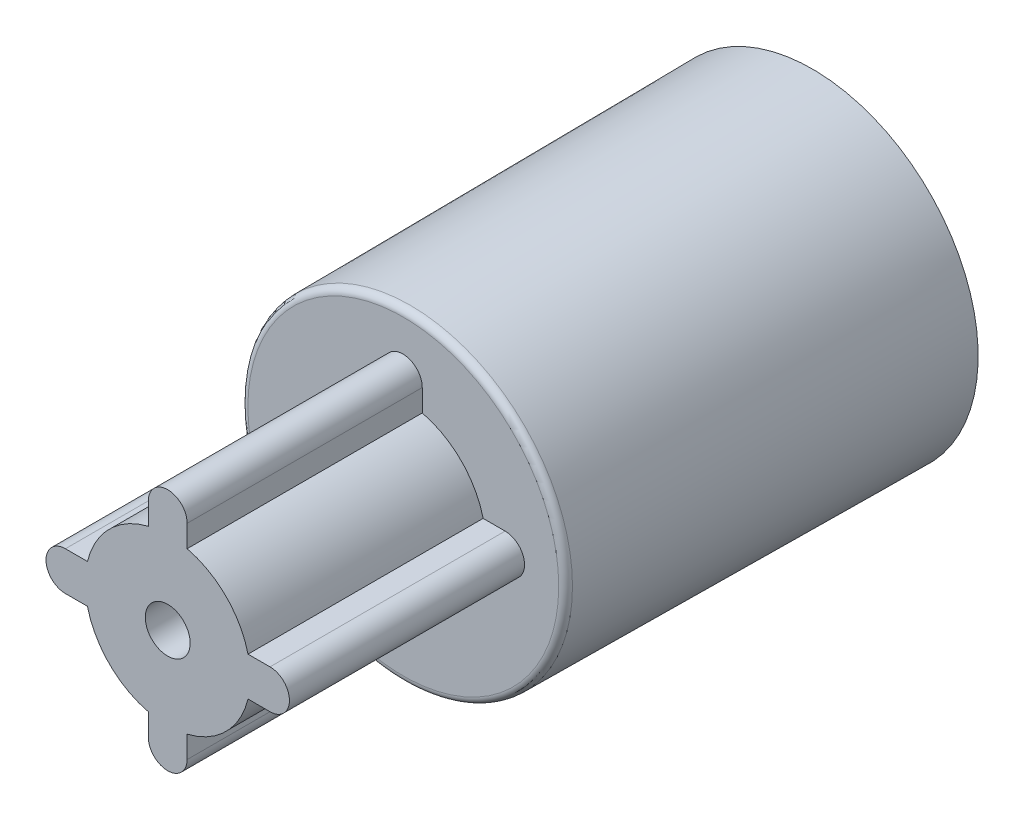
ISO-10303-21;
HEADER;
FILE_DESCRIPTION(('STEP AP214'),'2;1');
FILE_NAME('part.step','',(''),(''),'','','');
FILE_SCHEMA(('AUTOMOTIVE_DESIGN { 1 0 10303 214 1 1 1 1 }'));
ENDSEC;
DATA;
#1=APPLICATION_CONTEXT('core data for automotive mechanical design processes');
#2=APPLICATION_PROTOCOL_DEFINITION('international standard','automotive_design',2000,#1);
#3=PRODUCT_CONTEXT('',#1,'mechanical');
#4=PRODUCT('Part','Part','',(#3));
#5=PRODUCT_RELATED_PRODUCT_CATEGORY('part','',(#4));
#6=PRODUCT_DEFINITION_FORMATION('','',#4);
#7=PRODUCT_DEFINITION_CONTEXT('part definition',#1,'design');
#8=PRODUCT_DEFINITION('design','',#6,#7);
#9=PRODUCT_DEFINITION_SHAPE('','',#8);
#10=(LENGTH_UNIT() NAMED_UNIT(*) SI_UNIT(.MILLI.,.METRE.));
#11=(NAMED_UNIT(*) PLANE_ANGLE_UNIT() SI_UNIT($,.RADIAN.));
#12=(NAMED_UNIT(*) SI_UNIT($,.STERADIAN.) SOLID_ANGLE_UNIT());
#13=UNCERTAINTY_MEASURE_WITH_UNIT(LENGTH_MEASURE(1.E-05),#10,'distance_accuracy_value','');
#14=(GEOMETRIC_REPRESENTATION_CONTEXT(3) GLOBAL_UNCERTAINTY_ASSIGNED_CONTEXT((#13)) GLOBAL_UNIT_ASSIGNED_CONTEXT((#10,
#11,#12)) REPRESENTATION_CONTEXT('',''));
#15=CARTESIAN_POINT('',(0.,0.,0.));
#16=DIRECTION('',(0.,0.,1.));
#17=DIRECTION('',(1.,0.,0.));
#18=AXIS2_PLACEMENT_3D('',#15,#16,#17);
#19=CARTESIAN_POINT('',(-9.71554711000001,-9.79027858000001,0.));
#20=DIRECTION('',(0.,0.,1.));
#21=DIRECTION('',(0.999999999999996,0.,0.));
#22=AXIS2_PLACEMENT_3D('',#19,#20,#21);
#23=PLANE('',#22);
#24=CARTESIAN_POINT('',(-0.0263313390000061,6.01660899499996,0.));
#25=DIRECTION('',(0.,0.,-1.));
#26=DIRECTION('',(0.,0.999999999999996,0.));
#27=AXIS2_PLACEMENT_3D('',#24,#25,#26);
#28=CIRCLE('',#27,1.125);
#29=CARTESIAN_POINT('',(1.09866866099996,6.01660899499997,0.));
#30=VERTEX_POINT('',#29);
#31=CARTESIAN_POINT('',(-1.15133133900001,6.01660899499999,0.));
#32=VERTEX_POINT('',#31);
#33=EDGE_CURVE('E209',#30,#32,#28,.F.);
#34=ORIENTED_EDGE('',*,*,#33,.T.);
#35=DIRECTION('',(0.,0.999999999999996,0.));
#36=VECTOR('',#35,1.);
#37=CARTESIAN_POINT('',(-1.15133133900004,5.37910899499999,0.));
#38=LINE('',#37,#36);
#39=CARTESIAN_POINT('',(-1.151331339,4.74160899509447,0.));
#40=VERTEX_POINT('',#39);
#41=EDGE_CURVE('E214',#40,#32,#38,.T.);
#42=ORIENTED_EDGE('',*,*,#41,.F.);
#43=CARTESIAN_POINT('',(-0.0263313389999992,0.0907381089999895,0.));
#44=DIRECTION('',(0.,0.,-1.));
#45=DIRECTION('',(0.,0.999999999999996,0.));
#46=AXIS2_PLACEMENT_3D('',#43,#44,#45);
#47=CIRCLE('',#46,4.785);
#48=CARTESIAN_POINT('',(-4.67720222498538,1.21573810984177,0.));
#49=VERTEX_POINT('',#48);
#50=EDGE_CURVE('E235',#40,#49,#47,.F.);
#51=ORIENTED_EDGE('',*,*,#50,.T.);
#52=DIRECTION('',(-0.999999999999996,0.,0.));
#53=VECTOR('',#52,1.);
#54=CARTESIAN_POINT('',(-5.31470222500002,1.215738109,0.));
#55=LINE('',#54,#53);
#56=CARTESIAN_POINT('',(-5.952202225,1.215738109,0.));
#57=VERTEX_POINT('',#56);
#58=EDGE_CURVE('E243',#49,#57,#55,.T.);
#59=ORIENTED_EDGE('',*,*,#58,.T.);
#60=CARTESIAN_POINT('',(-5.95220222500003,0.0907381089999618,0.));
#61=DIRECTION('',(0.,0.,-1.));
#62=DIRECTION('',(0.,0.999999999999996,0.));
#63=AXIS2_PLACEMENT_3D('',#60,#61,#62);
#64=CIRCLE('',#63,1.125);
#65=CARTESIAN_POINT('',(-5.95220222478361,-1.034261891,0.));
#66=VERTEX_POINT('',#65);
#67=EDGE_CURVE('E337',#57,#66,#64,.F.);
#68=ORIENTED_EDGE('',*,*,#67,.T.);
#69=DIRECTION('',(-0.999999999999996,0.,0.));
#70=VECTOR('',#69,1.);
#71=CARTESIAN_POINT('',(-5.31470222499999,-1.034261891,0.));
#72=LINE('',#71,#70);
#73=CARTESIAN_POINT('',(-4.67720222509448,-1.03426189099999,0.));
#74=VERTEX_POINT('',#73);
#75=EDGE_CURVE('E247',#74,#66,#72,.T.);
#76=ORIENTED_EDGE('',*,*,#75,.F.);
#77=CARTESIAN_POINT('',(-0.0263313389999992,0.0907381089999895,0.));
#78=DIRECTION('',(0.,0.,-1.));
#79=DIRECTION('',(0.,0.999999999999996,0.));
#80=AXIS2_PLACEMENT_3D('',#77,#78,#79);
#81=CIRCLE('',#80,4.785);
#82=CARTESIAN_POINT('',(-1.15133133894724,-4.56013277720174,0.));
#83=VERTEX_POINT('',#82);
#84=EDGE_CURVE('E251',#74,#83,#81,.F.);
#85=ORIENTED_EDGE('',*,*,#84,.T.);
#86=DIRECTION('',(0.,-0.999999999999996,0.));
#87=VECTOR('',#86,1.);
#88=CARTESIAN_POINT('',(-1.151331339,-5.197632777,0.));
#89=LINE('',#88,#87);
#90=CARTESIAN_POINT('',(-1.151331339,-5.83513277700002,0.));
#91=VERTEX_POINT('',#90);
#92=EDGE_CURVE('E252',#83,#91,#89,.T.);
#93=ORIENTED_EDGE('',*,*,#92,.T.);
#94=CARTESIAN_POINT('',(-0.0263313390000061,-5.83513277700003,0.));
#95=DIRECTION('',(0.,0.,-1.));
#96=DIRECTION('',(0.,0.999999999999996,0.));
#97=AXIS2_PLACEMENT_3D('',#94,#95,#96);
#98=CIRCLE('',#97,1.125);
#99=CARTESIAN_POINT('',(1.09866866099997,-5.83513277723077,0.));
#100=VERTEX_POINT('',#99);
#101=EDGE_CURVE('E342',#91,#100,#98,.F.);
#102=ORIENTED_EDGE('',*,*,#101,.T.);
#103=DIRECTION('',(0.,0.999999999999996,0.));
#104=VECTOR('',#103,1.);
#105=CARTESIAN_POINT('',(1.098668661,-5.197632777,0.));
#106=LINE('',#105,#104);
#107=CARTESIAN_POINT('',(1.09866866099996,-4.56013277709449,0.));
#108=VERTEX_POINT('',#107);
#109=EDGE_CURVE('E257',#100,#108,#106,.T.);
#110=ORIENTED_EDGE('',*,*,#109,.T.);
#111=CARTESIAN_POINT('',(-0.0263313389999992,0.0907381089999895,0.));
#112=DIRECTION('',(0.,0.,-1.));
#113=DIRECTION('',(0.,0.999999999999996,0.));
#114=AXIS2_PLACEMENT_3D('',#111,#112,#113);
#115=CIRCLE('',#114,4.785);
#116=CARTESIAN_POINT('',(4.62453954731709,-1.03426189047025,0.));
#117=VERTEX_POINT('',#116);
#118=EDGE_CURVE('E345',#108,#117,#115,.F.);
#119=ORIENTED_EDGE('',*,*,#118,.T.);
#120=DIRECTION('',(0.999999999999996,0.,0.));
#121=VECTOR('',#120,1.);
#122=CARTESIAN_POINT('',(5.262039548,-1.034261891,0.));
#123=LINE('',#122,#121);
#124=CARTESIAN_POINT('',(5.89953954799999,-1.034261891,0.));
#125=VERTEX_POINT('',#124);
#126=EDGE_CURVE('E262',#117,#125,#123,.T.);
#127=ORIENTED_EDGE('',*,*,#126,.T.);
#128=CARTESIAN_POINT('',(5.899539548,0.0907381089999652,0.));
#129=DIRECTION('',(0.,0.,-1.));
#130=DIRECTION('',(0.,0.999999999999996,0.));
#131=AXIS2_PLACEMENT_3D('',#128,#129,#130);
#132=CIRCLE('',#131,1.125);
#133=CARTESIAN_POINT('',(5.89953954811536,1.215738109,0.));
#134=VERTEX_POINT('',#133);
#135=EDGE_CURVE('E348',#125,#134,#132,.F.);
#136=ORIENTED_EDGE('',*,*,#135,.T.);
#137=DIRECTION('',(0.999999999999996,0.,0.));
#138=VECTOR('',#137,1.);
#139=CARTESIAN_POINT('',(5.262039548,1.215738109,0.));
#140=LINE('',#139,#138);
#141=CARTESIAN_POINT('',(4.62453954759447,1.215738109,0.));
#142=VERTEX_POINT('',#141);
#143=EDGE_CURVE('E267',#142,#134,#140,.T.);
#144=ORIENTED_EDGE('',*,*,#143,.F.);
#145=CARTESIAN_POINT('',(-0.0263313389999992,0.0907381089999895,0.));
#146=DIRECTION('',(0.,0.,-1.));
#147=DIRECTION('',(0.,0.999999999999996,0.));
#148=AXIS2_PLACEMENT_3D('',#145,#146,#147);
#149=CIRCLE('',#148,4.785);
#150=CARTESIAN_POINT('',(1.09866865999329,4.74160899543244,0.));
#151=VERTEX_POINT('',#150);
#152=EDGE_CURVE('E270',#142,#151,#149,.F.);
#153=ORIENTED_EDGE('',*,*,#152,.T.);
#154=DIRECTION('',(0.,0.999999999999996,0.));
#155=VECTOR('',#154,1.);
#156=CARTESIAN_POINT('',(1.098668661,5.379108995,0.));
#157=LINE('',#156,#155);
#158=EDGE_CURVE('E217',#151,#30,#157,.T.);
#159=ORIENTED_EDGE('',*,*,#158,.T.);
#160=EDGE_LOOP('',(#34,#42,#51,#59,#68,#76,#85,#93,#102,#110,#119,#127,#136,#144,#153,#159));
#161=FACE_BOUND('',#160,.T.);
#162=CARTESIAN_POINT('',(0.,0.,0.));
#163=DIRECTION('',(0.,0.,-1.));
#164=DIRECTION('',(-0.999999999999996,0.,0.));
#165=AXIS2_PLACEMENT_3D('',#162,#163,#164);
#166=CIRCLE('',#165,9.6);
#167=CARTESIAN_POINT('',(-9.59999999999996,0.,0.));
#168=VERTEX_POINT('',#167);
#169=EDGE_CURVE('E221',#168,#168,#166,.F.);
#170=ORIENTED_EDGE('',*,*,#169,.F.);
#171=EDGE_LOOP('',(#170));
#172=FACE_BOUND('',#171,.T.);
#173=ADVANCED_FACE('F36',(#161,#172),#23,.F.);
#174=CARTESIAN_POINT('',(0.,0.,23.303375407));
#175=DIRECTION('',(0.,0.,-1.));
#176=DIRECTION('',(-0.999999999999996,0.,0.));
#177=AXIS2_PLACEMENT_3D('',#174,#175,#176);
#178=CONICAL_SURFACE('',#177,9.403347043,0.00843861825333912);
#179=CARTESIAN_POINT('',(0.,0.,23.3033754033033));
#180=DIRECTION('',(0.,0.,1.));
#181=DIRECTION('',(0.999999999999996,0.,0.));
#182=AXIS2_PLACEMENT_3D('',#179,#180,#181);
#183=CIRCLE('',#182,9.40334704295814);
#184=CARTESIAN_POINT('',(9.4033470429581,0.,23.3033754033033));
#185=VERTEX_POINT('',#184);
#186=EDGE_CURVE('E502',#185,#185,#183,.T.);
#187=ORIENTED_EDGE('',*,*,#186,.F.);
#188=EDGE_LOOP('',(#187));
#189=FACE_BOUND('',#188,.T.);
#190=ORIENTED_EDGE('',*,*,#169,.T.);
#191=EDGE_LOOP('',(#190));
#192=FACE_BOUND('',#191,.T.);
#193=ADVANCED_FACE('F638',(#189,#192),#178,.T.);
#194=CARTESIAN_POINT('',(-0.02633133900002,6.016608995,21.7));
#195=DIRECTION('',(0.,0.,-1.));
#196=DIRECTION('',(0.,0.999999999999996,0.));
#197=AXIS2_PLACEMENT_3D('',#194,#195,#196);
#198=CYLINDRICAL_SURFACE('',#197,1.125);
#199=DIRECTION('',(0.,0.,1.));
#200=VECTOR('',#199,1.);
#201=CARTESIAN_POINT('',(1.09866866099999,6.01660899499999,10.85));
#202=LINE('',#201,#200);
#203=CARTESIAN_POINT('',(1.09866866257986,6.016608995,21.7));
#204=VERTEX_POINT('',#203);
#205=EDGE_CURVE('E220',#30,#204,#202,.T.);
#206=ORIENTED_EDGE('',*,*,#205,.T.);
#207=CARTESIAN_POINT('',(-0.02633133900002,6.016608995,21.7));
#208=DIRECTION('',(0.,0.,-1.));
#209=DIRECTION('',(0.,0.999999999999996,0.));
#210=AXIS2_PLACEMENT_3D('',#207,#208,#209);
#211=CIRCLE('',#210,1.125);
#212=CARTESIAN_POINT('',(-1.15133134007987,6.016608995,21.7));
#213=VERTEX_POINT('',#212);
#214=EDGE_CURVE('E227',#213,#204,#211,.T.);
#215=ORIENTED_EDGE('',*,*,#214,.F.);
#216=DIRECTION('',(0.,0.,1.));
#217=VECTOR('',#216,1.);
#218=CARTESIAN_POINT('',(-1.151331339,6.016608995,10.85));
#219=LINE('',#218,#217);
#220=EDGE_CURVE('E224',#32,#213,#219,.T.);
#221=ORIENTED_EDGE('',*,*,#220,.F.);
#222=ORIENTED_EDGE('',*,*,#33,.F.);
#223=EDGE_LOOP('',(#206,#215,#221,#222));
#224=FACE_BOUND('',#223,.T.);
#225=ADVANCED_FACE('F225',(#224),#198,.F.);
#226=CARTESIAN_POINT('',(1.09866866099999,4.741608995,0.));
#227=DIRECTION('',(0.999999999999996,0.,0.));
#228=DIRECTION('',(0.,0.999999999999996,0.));
#229=AXIS2_PLACEMENT_3D('',#226,#227,#228);
#230=PLANE('',#229);
#231=DIRECTION('',(0.,0.,1.));
#232=VECTOR('',#231,1.);
#233=CARTESIAN_POINT('',(1.09866865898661,4.74160899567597,10.85));
#234=LINE('',#233,#232);
#235=CARTESIAN_POINT('',(1.09866866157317,4.74160899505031,21.7));
#236=VERTEX_POINT('',#235);
#237=EDGE_CURVE('E272',#151,#236,#234,.T.);
#238=ORIENTED_EDGE('',*,*,#237,.T.);
#239=DIRECTION('',(0.,-0.999999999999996,0.));
#240=VECTOR('',#239,1.);
#241=CARTESIAN_POINT('',(1.0986686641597,0.0907381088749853,21.7));
#242=LINE('',#241,#240);
#243=EDGE_CURVE('E334',#204,#236,#242,.T.);
#244=ORIENTED_EDGE('',*,*,#243,.F.);
#245=ORIENTED_EDGE('',*,*,#205,.F.);
#246=ORIENTED_EDGE('',*,*,#158,.F.);
#247=EDGE_LOOP('',(#238,#244,#245,#246));
#248=FACE_BOUND('',#247,.T.);
#249=ADVANCED_FACE('F639',(#248),#230,.F.);
#250=CARTESIAN_POINT('',(-0.0263313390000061,0.0907381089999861,21.7));
#251=DIRECTION('',(0.,0.,-1.));
#252=DIRECTION('',(0.,0.999999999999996,0.));
#253=AXIS2_PLACEMENT_3D('',#250,#251,#252);
#254=CYLINDRICAL_SURFACE('',#253,4.785);
#255=DIRECTION('',(0.,0.,-1.));
#256=VECTOR('',#255,1.);
#257=CARTESIAN_POINT('',(4.624539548,1.215738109,10.85));
#258=LINE('',#257,#256);
#259=CARTESIAN_POINT('',(4.62453954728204,1.2157381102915,21.7));
#260=VERTEX_POINT('',#259);
#261=EDGE_CURVE('E269',#260,#142,#258,.T.);
#262=ORIENTED_EDGE('',*,*,#261,.F.);
#263=CARTESIAN_POINT('',(-0.0263313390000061,0.0907381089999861,21.7));
#264=DIRECTION('',(0.,0.,-1.));
#265=DIRECTION('',(0.,0.999999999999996,0.));
#266=AXIS2_PLACEMENT_3D('',#263,#264,#265);
#267=CIRCLE('',#266,4.785);
#268=EDGE_CURVE('E331',#236,#260,#267,.T.);
#269=ORIENTED_EDGE('',*,*,#268,.F.);
#270=ORIENTED_EDGE('',*,*,#237,.F.);
#271=ORIENTED_EDGE('',*,*,#152,.F.);
#272=EDGE_LOOP('',(#262,#269,#270,#271));
#273=FACE_BOUND('',#272,.T.);
#274=ADVANCED_FACE('F642',(#273),#254,.F.);
#275=CARTESIAN_POINT('',(4.624539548,1.215738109,0.));
#276=DIRECTION('',(0.,-0.999999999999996,0.));
#277=DIRECTION('',(0.999999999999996,0.,0.));
#278=AXIS2_PLACEMENT_3D('',#275,#276,#277);
#279=PLANE('',#278);
#280=DIRECTION('',(0.999999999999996,0.,0.));
#281=VECTOR('',#280,1.);
#282=CARTESIAN_POINT('',(-0.0263313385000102,1.21573811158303,21.7));
#283=LINE('',#282,#281);
#284=CARTESIAN_POINT('',(5.89953954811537,1.21573811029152,21.7));
#285=VERTEX_POINT('',#284);
#286=EDGE_CURVE('E330',#260,#285,#283,.T.);
#287=ORIENTED_EDGE('',*,*,#286,.F.);
#288=ORIENTED_EDGE('',*,*,#261,.T.);
#289=ORIENTED_EDGE('',*,*,#143,.T.);
#290=DIRECTION('',(0.,0.,1.));
#291=VECTOR('',#290,1.);
#292=CARTESIAN_POINT('',(5.89953954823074,1.215738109,10.85));
#293=LINE('',#292,#291);
#294=EDGE_CURVE('E351',#134,#285,#293,.T.);
#295=ORIENTED_EDGE('',*,*,#294,.T.);
#296=EDGE_LOOP('',(#287,#288,#289,#295));
#297=FACE_BOUND('',#296,.T.);
#298=ADVANCED_FACE('F644',(#297),#279,.T.);
#299=CARTESIAN_POINT('',(5.89953954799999,0.0907381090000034,21.7));
#300=DIRECTION('',(0.,0.,-1.));
#301=DIRECTION('',(0.,0.999999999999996,0.));
#302=AXIS2_PLACEMENT_3D('',#299,#300,#301);
#303=CYLINDRICAL_SURFACE('',#302,1.125);
#304=DIRECTION('',(0.,0.,1.));
#305=VECTOR('',#304,1.);
#306=CARTESIAN_POINT('',(5.89953954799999,-1.034261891,10.85));
#307=LINE('',#306,#305);
#308=CARTESIAN_POINT('',(5.89953954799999,-1.03426189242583,21.7));
#309=VERTEX_POINT('',#308);
#310=EDGE_CURVE('E266',#125,#309,#307,.T.);
#311=ORIENTED_EDGE('',*,*,#310,.T.);
#312=CARTESIAN_POINT('',(5.89953954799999,0.0907381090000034,21.7));
#313=DIRECTION('',(0.,0.,-1.));
#314=DIRECTION('',(0.,0.999999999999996,0.));
#315=AXIS2_PLACEMENT_3D('',#312,#313,#314);
#316=CIRCLE('',#315,1.125);
#317=EDGE_CURVE('E327',#285,#309,#316,.T.);
#318=ORIENTED_EDGE('',*,*,#317,.F.);
#319=ORIENTED_EDGE('',*,*,#294,.F.);
#320=ORIENTED_EDGE('',*,*,#135,.F.);
#321=EDGE_LOOP('',(#311,#318,#319,#320));
#322=FACE_BOUND('',#321,.T.);
#323=ADVANCED_FACE('F647',(#322),#303,.F.);
#324=CARTESIAN_POINT('',(4.624539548,-1.034261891,0.));
#325=DIRECTION('',(0.,-0.999999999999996,0.));
#326=DIRECTION('',(0.999999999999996,0.,0.));
#327=AXIS2_PLACEMENT_3D('',#324,#325,#326);
#328=PLANE('',#327);
#329=DIRECTION('',(0.,0.,1.));
#330=VECTOR('',#329,1.);
#331=CARTESIAN_POINT('',(4.62453954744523,-1.03426188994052,10.85));
#332=LINE('',#331,#330);
#333=CARTESIAN_POINT('',(4.62453954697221,-1.0342618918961,21.7));
#334=VERTEX_POINT('',#333);
#335=EDGE_CURVE('E265',#117,#334,#332,.T.);
#336=ORIENTED_EDGE('',*,*,#335,.T.);
#337=DIRECTION('',(-0.999999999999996,0.,0.));
#338=VECTOR('',#337,1.);
#339=CARTESIAN_POINT('',(-0.0263313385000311,-1.03426189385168,21.7));
#340=LINE('',#339,#338);
#341=EDGE_CURVE('E326',#309,#334,#340,.T.);
#342=ORIENTED_EDGE('',*,*,#341,.F.);
#343=ORIENTED_EDGE('',*,*,#310,.F.);
#344=ORIENTED_EDGE('',*,*,#126,.F.);
#345=EDGE_LOOP('',(#336,#342,#343,#344));
#346=FACE_BOUND('',#345,.T.);
#347=ADVANCED_FACE('F649',(#346),#328,.F.);
#348=CARTESIAN_POINT('',(-0.0263313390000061,0.0907381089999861,21.7));
#349=DIRECTION('',(0.,0.,-1.));
#350=DIRECTION('',(0.,0.999999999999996,0.));
#351=AXIS2_PLACEMENT_3D('',#348,#349,#350);
#352=CYLINDRICAL_SURFACE('',#351,4.785);
#353=DIRECTION('',(0.,0.,1.));
#354=VECTOR('',#353,1.);
#355=CARTESIAN_POINT('',(1.09866866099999,-4.560132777,10.85));
#356=LINE('',#355,#354);
#357=CARTESIAN_POINT('',(1.09866866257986,-4.56013277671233,21.7));
#358=VERTEX_POINT('',#357);
#359=EDGE_CURVE('E261',#108,#358,#356,.T.);
#360=ORIENTED_EDGE('',*,*,#359,.T.);
#361=CARTESIAN_POINT('',(-0.0263313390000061,0.0907381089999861,21.7));
#362=DIRECTION('',(0.,0.,-1.));
#363=DIRECTION('',(0.,0.999999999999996,0.));
#364=AXIS2_PLACEMENT_3D('',#361,#362,#363);
#365=CIRCLE('',#364,4.785);
#366=EDGE_CURVE('E323',#334,#358,#365,.T.);
#367=ORIENTED_EDGE('',*,*,#366,.F.);
#368=ORIENTED_EDGE('',*,*,#335,.F.);
#369=ORIENTED_EDGE('',*,*,#118,.F.);
#370=EDGE_LOOP('',(#360,#367,#368,#369));
#371=FACE_BOUND('',#370,.T.);
#372=ADVANCED_FACE('F652',(#371),#352,.F.);
#373=CARTESIAN_POINT('',(1.09866866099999,-5.83513277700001,0.));
#374=DIRECTION('',(0.999999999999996,0.,0.));
#375=DIRECTION('',(0.,0.999999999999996,0.));
#376=AXIS2_PLACEMENT_3D('',#373,#374,#375);
#377=PLANE('',#376);
#378=DIRECTION('',(0.,0.,1.));
#379=VECTOR('',#378,1.);
#380=CARTESIAN_POINT('',(1.09866866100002,-5.83513277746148,10.85));
#381=LINE('',#380,#379);
#382=CARTESIAN_POINT('',(1.09866866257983,-5.83513277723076,21.7));
#383=VERTEX_POINT('',#382);
#384=EDGE_CURVE('E260',#100,#383,#381,.T.);
#385=ORIENTED_EDGE('',*,*,#384,.T.);
#386=DIRECTION('',(0.,-0.999999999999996,0.));
#387=VECTOR('',#386,1.);
#388=CARTESIAN_POINT('',(1.0986686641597,0.0907381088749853,21.7));
#389=LINE('',#388,#387);
#390=EDGE_CURVE('E322',#358,#383,#389,.T.);
#391=ORIENTED_EDGE('',*,*,#390,.F.);
#392=ORIENTED_EDGE('',*,*,#359,.F.);
#393=ORIENTED_EDGE('',*,*,#109,.F.);
#394=EDGE_LOOP('',(#385,#391,#392,#393));
#395=FACE_BOUND('',#394,.T.);
#396=ADVANCED_FACE('F654',(#395),#377,.F.);
#397=CARTESIAN_POINT('',(-0.0263313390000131,-5.83513277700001,21.6999999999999));
#398=DIRECTION('',(0.,0.,-1.));
#399=DIRECTION('',(0.,0.999999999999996,0.));
#400=AXIS2_PLACEMENT_3D('',#397,#398,#399);
#401=CYLINDRICAL_SURFACE('',#400,1.125);
#402=DIRECTION('',(0.,0.,1.));
#403=VECTOR('',#402,1.);
#404=CARTESIAN_POINT('',(-1.15133133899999,-5.835132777,10.85));
#405=LINE('',#404,#403);
#406=CARTESIAN_POINT('',(-1.15133134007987,-5.83513277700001,21.7));
#407=VERTEX_POINT('',#406);
#408=EDGE_CURVE('E256',#91,#407,#405,.T.);
#409=ORIENTED_EDGE('',*,*,#408,.T.);
#410=CARTESIAN_POINT('',(-0.0263313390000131,-5.83513277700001,21.6999999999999));
#411=DIRECTION('',(0.,0.,-1.));
#412=DIRECTION('',(0.,0.999999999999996,0.));
#413=AXIS2_PLACEMENT_3D('',#410,#411,#412);
#414=CIRCLE('',#413,1.125);
#415=EDGE_CURVE('E319',#383,#407,#414,.T.);
#416=ORIENTED_EDGE('',*,*,#415,.F.);
#417=ORIENTED_EDGE('',*,*,#384,.F.);
#418=ORIENTED_EDGE('',*,*,#101,.F.);
#419=EDGE_LOOP('',(#409,#416,#417,#418));
#420=FACE_BOUND('',#419,.T.);
#421=ADVANCED_FACE('F657',(#420),#401,.F.);
#422=CARTESIAN_POINT('',(-1.15133133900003,-4.56013277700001,0.));
#423=DIRECTION('',(-0.999999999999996,0.,0.));
#424=DIRECTION('',(0.,-0.999999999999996,0.));
#425=AXIS2_PLACEMENT_3D('',#422,#423,#424);
#426=PLANE('',#425);
#427=DIRECTION('',(0.,0.,1.));
#428=VECTOR('',#427,1.);
#429=CARTESIAN_POINT('',(-1.15133133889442,-4.56013277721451,10.85));
#430=LINE('',#429,#428);
#431=CARTESIAN_POINT('',(-1.15133134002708,-4.56013277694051,21.7));
#432=VERTEX_POINT('',#431);
#433=EDGE_CURVE('E255',#83,#432,#430,.T.);
#434=ORIENTED_EDGE('',*,*,#433,.T.);
#435=DIRECTION('',(0.,0.999999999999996,0.));
#436=VECTOR('',#435,1.);
#437=CARTESIAN_POINT('',(-1.15133134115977,0.0907381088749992,21.7));
#438=LINE('',#437,#436);
#439=EDGE_CURVE('E318',#407,#432,#438,.T.);
#440=ORIENTED_EDGE('',*,*,#439,.F.);
#441=ORIENTED_EDGE('',*,*,#408,.F.);
#442=ORIENTED_EDGE('',*,*,#92,.F.);
#443=EDGE_LOOP('',(#434,#440,#441,#442));
#444=FACE_BOUND('',#443,.T.);
#445=ADVANCED_FACE('F659',(#444),#426,.F.);
#446=CARTESIAN_POINT('',(-0.0263313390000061,0.0907381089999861,21.7));
#447=DIRECTION('',(0.,0.,-1.));
#448=DIRECTION('',(0.,0.999999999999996,0.));
#449=AXIS2_PLACEMENT_3D('',#446,#447,#448);
#450=CYLINDRICAL_SURFACE('',#449,4.785);
#451=DIRECTION('',(0.,0.,-1.));
#452=VECTOR('',#451,1.);
#453=CARTESIAN_POINT('',(-4.677202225,-1.034261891,10.85));
#454=LINE('',#453,#452);
#455=CARTESIAN_POINT('',(-4.67720222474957,-1.03426189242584,21.7));
#456=VERTEX_POINT('',#455);
#457=EDGE_CURVE('E250',#456,#74,#454,.T.);
#458=ORIENTED_EDGE('',*,*,#457,.F.);
#459=CARTESIAN_POINT('',(-0.0263313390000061,0.0907381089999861,21.7));
#460=DIRECTION('',(0.,0.,-1.));
#461=DIRECTION('',(0.,0.999999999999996,0.));
#462=AXIS2_PLACEMENT_3D('',#459,#460,#461);
#463=CIRCLE('',#462,4.785);
#464=EDGE_CURVE('E315',#432,#456,#463,.T.);
#465=ORIENTED_EDGE('',*,*,#464,.F.);
#466=ORIENTED_EDGE('',*,*,#433,.F.);
#467=ORIENTED_EDGE('',*,*,#84,.F.);
#468=EDGE_LOOP('',(#458,#465,#466,#467));
#469=FACE_BOUND('',#468,.T.);
#470=ADVANCED_FACE('F662',(#469),#450,.F.);
#471=CARTESIAN_POINT('',(-4.677202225,-1.034261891,0.));
#472=DIRECTION('',(0.,0.999999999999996,0.));
#473=DIRECTION('',(-0.999999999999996,0.,0.));
#474=AXIS2_PLACEMENT_3D('',#471,#472,#473);
#475=PLANE('',#474);
#476=DIRECTION('',(-0.999999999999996,0.,0.));
#477=VECTOR('',#476,1.);
#478=CARTESIAN_POINT('',(-0.0263313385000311,-1.03426189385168,21.7));
#479=LINE('',#478,#477);
#480=CARTESIAN_POINT('',(-5.95220222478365,-1.03426189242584,21.7));
#481=VERTEX_POINT('',#480);
#482=EDGE_CURVE('E314',#456,#481,#479,.T.);
#483=ORIENTED_EDGE('',*,*,#482,.F.);
#484=ORIENTED_EDGE('',*,*,#457,.T.);
#485=ORIENTED_EDGE('',*,*,#75,.T.);
#486=DIRECTION('',(0.,0.,1.));
#487=VECTOR('',#486,1.);
#488=CARTESIAN_POINT('',(-5.95220222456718,-1.03426189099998,10.85));
#489=LINE('',#488,#487);
#490=EDGE_CURVE('E339',#66,#481,#489,.T.);
#491=ORIENTED_EDGE('',*,*,#490,.T.);
#492=EDGE_LOOP('',(#483,#484,#485,#491));
#493=FACE_BOUND('',#492,.T.);
#494=ADVANCED_FACE('F664',(#493),#475,.T.);
#495=CARTESIAN_POINT('',(-5.95220222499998,0.090738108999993,21.7));
#496=DIRECTION('',(0.,0.,-1.));
#497=DIRECTION('',(0.,0.999999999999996,0.));
#498=AXIS2_PLACEMENT_3D('',#495,#496,#497);
#499=CYLINDRICAL_SURFACE('',#498,1.125);
#500=CARTESIAN_POINT('',(-5.95220222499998,0.090738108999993,21.7));
#501=DIRECTION('',(0.,0.,-1.));
#502=DIRECTION('',(0.,0.999999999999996,0.));
#503=AXIS2_PLACEMENT_3D('',#500,#501,#502);
#504=CIRCLE('',#503,1.125);
#505=CARTESIAN_POINT('',(-5.952202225,1.21573811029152,21.7));
#506=VERTEX_POINT('',#505);
#507=EDGE_CURVE('E311',#481,#506,#504,.T.);
#508=ORIENTED_EDGE('',*,*,#507,.F.);
#509=ORIENTED_EDGE('',*,*,#490,.F.);
#510=ORIENTED_EDGE('',*,*,#67,.F.);
#511=DIRECTION('',(0.,0.,1.));
#512=VECTOR('',#511,1.);
#513=CARTESIAN_POINT('',(-5.952202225,1.215738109,10.85));
#514=LINE('',#513,#512);
#515=EDGE_CURVE('E246',#57,#506,#514,.T.);
#516=ORIENTED_EDGE('',*,*,#515,.T.);
#517=EDGE_LOOP('',(#508,#509,#510,#516));
#518=FACE_BOUND('',#517,.T.);
#519=ADVANCED_FACE('F667',(#518),#499,.F.);
#520=CARTESIAN_POINT('',(-4.67720222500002,1.21573810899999,0.));
#521=DIRECTION('',(0.,0.999999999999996,0.));
#522=DIRECTION('',(-0.999999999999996,0.,0.));
#523=AXIS2_PLACEMENT_3D('',#520,#521,#522);
#524=PLANE('',#523);
#525=DIRECTION('',(0.,0.,1.));
#526=VECTOR('',#525,1.);
#527=CARTESIAN_POINT('',(-4.67720222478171,1.21573811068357,10.85));
#528=LINE('',#527,#526);
#529=CARTESIAN_POINT('',(-4.67720222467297,1.21573811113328,21.7));
#530=VERTEX_POINT('',#529);
#531=EDGE_CURVE('E237',#49,#530,#528,.T.);
#532=ORIENTED_EDGE('',*,*,#531,.T.);
#533=DIRECTION('',(0.999999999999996,0.,0.));
#534=VECTOR('',#533,1.);
#535=CARTESIAN_POINT('',(-0.0263313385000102,1.21573811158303,21.7));
#536=LINE('',#535,#534);
#537=EDGE_CURVE('E310',#506,#530,#536,.T.);
#538=ORIENTED_EDGE('',*,*,#537,.F.);
#539=ORIENTED_EDGE('',*,*,#515,.F.);
#540=ORIENTED_EDGE('',*,*,#58,.F.);
#541=EDGE_LOOP('',(#532,#538,#539,#540));
#542=FACE_BOUND('',#541,.T.);
#543=ADVANCED_FACE('F669',(#542),#524,.F.);
#544=CARTESIAN_POINT('',(-0.0263313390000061,0.0907381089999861,21.7));
#545=DIRECTION('',(0.,0.,-1.));
#546=DIRECTION('',(0.,0.999999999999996,0.));
#547=AXIS2_PLACEMENT_3D('',#544,#545,#546);
#548=CYLINDRICAL_SURFACE('',#547,4.785);
#549=DIRECTION('',(0.,0.,-1.));
#550=VECTOR('',#549,1.);
#551=CARTESIAN_POINT('',(-1.15133133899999,4.741608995,10.85));
#552=LINE('',#551,#550);
#553=CARTESIAN_POINT('',(-1.15133134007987,4.74160899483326,21.7));
#554=VERTEX_POINT('',#553);
#555=EDGE_CURVE('E231',#554,#40,#552,.T.);
#556=ORIENTED_EDGE('',*,*,#555,.F.);
#557=CARTESIAN_POINT('',(-0.0263313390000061,0.0907381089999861,21.7));
#558=DIRECTION('',(0.,0.,-1.));
#559=DIRECTION('',(0.,0.999999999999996,0.));
#560=AXIS2_PLACEMENT_3D('',#557,#558,#559);
#561=CIRCLE('',#560,4.785);
#562=EDGE_CURVE('E306',#530,#554,#561,.T.);
#563=ORIENTED_EDGE('',*,*,#562,.F.);
#564=ORIENTED_EDGE('',*,*,#531,.F.);
#565=ORIENTED_EDGE('',*,*,#50,.F.);
#566=EDGE_LOOP('',(#556,#563,#564,#565));
#567=FACE_BOUND('',#566,.T.);
#568=ADVANCED_FACE('F409',(#567),#548,.F.);
#569=CARTESIAN_POINT('',(-1.15133133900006,4.74160899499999,0.));
#570=DIRECTION('',(0.999999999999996,0.,0.));
#571=DIRECTION('',(0.,0.999999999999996,0.));
#572=AXIS2_PLACEMENT_3D('',#569,#570,#571);
#573=PLANE('',#572);
#574=DIRECTION('',(0.,0.999999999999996,0.));
#575=VECTOR('',#574,1.);
#576=CARTESIAN_POINT('',(-1.15133134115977,0.0907381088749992,21.7));
#577=LINE('',#576,#575);
#578=EDGE_CURVE('E309',#554,#213,#577,.T.);
#579=ORIENTED_EDGE('',*,*,#578,.F.);
#580=ORIENTED_EDGE('',*,*,#555,.T.);
#581=ORIENTED_EDGE('',*,*,#41,.T.);
#582=ORIENTED_EDGE('',*,*,#220,.T.);
#583=EDGE_LOOP('',(#579,#580,#581,#582));
#584=FACE_BOUND('',#583,.T.);
#585=ADVANCED_FACE('F234',(#584),#573,.T.);
#586=CARTESIAN_POINT('',(0.,0.,23.3));
#587=DIRECTION('',(0.,0.,1.));
#588=DIRECTION('',(1.,0.,0.));
#589=AXIS2_PLACEMENT_3D('',#586,#587,#588);
#590=TOROIDAL_SURFACE('',#589,9.00336128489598,0.4);
#591=ORIENTED_EDGE('',*,*,#186,.T.);
#592=EDGE_LOOP('',(#591));
#593=FACE_BOUND('',#592,.T.);
#594=CARTESIAN_POINT('',(0.,0.,23.7));
#595=DIRECTION('',(0.,0.,-1.));
#596=DIRECTION('',(1.,-1.79588024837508E-10,0.));
#597=AXIS2_PLACEMENT_3D('',#594,#595,#596);
#598=CIRCLE('',#597,9.00336128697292);
#599=CARTESIAN_POINT('',(-9.00336128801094,-3.52647078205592E-09,23.7000000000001));
#600=VERTEX_POINT('',#599);
#601=CARTESIAN_POINT('',(9.0033612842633,-1.95728155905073E-09,23.7));
#602=VERTEX_POINT('',#601);
#603=EDGE_CURVE('E448',#600,#602,#598,.F.);
#604=ORIENTED_EDGE('',*,*,#603,.F.);
#605=CARTESIAN_POINT('',(0.,0.,23.7));
#606=DIRECTION('',(0.,0.,-1.));
#607=DIRECTION('',(-1.,-4.10205644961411E-10,0.));
#608=AXIS2_PLACEMENT_3D('',#605,#606,#607);
#609=CIRCLE('',#608,9.00336128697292);
#610=EDGE_CURVE('E361',#602,#600,#609,.F.);
#611=ORIENTED_EDGE('',*,*,#610,.F.);
#612=EDGE_LOOP('',(#604,#611));
#613=FACE_BOUND('',#612,.T.);
#614=ADVANCED_FACE('F396',(#593,#613),#590,.T.);
#615=CARTESIAN_POINT('',(-1.15133133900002,4.74160899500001,23.7));
#616=DIRECTION('',(0.999999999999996,0.,0.));
#617=DIRECTION('',(0.,0.999999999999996,0.));
#618=AXIS2_PLACEMENT_3D('',#615,#616,#617);
#619=PLANE('',#618);
#620=DIRECTION('',(0.,0.,-1.));
#621=VECTOR('',#620,1.);
#622=CARTESIAN_POINT('',(-1.1513313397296,4.74160899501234,31.5));
#623=LINE('',#622,#621);
#624=CARTESIAN_POINT('',(-1.1513313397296,4.74160899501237,37.3199999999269));
#625=VERTEX_POINT('',#624);
#626=CARTESIAN_POINT('',(-1.151331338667,4.74160899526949,23.7));
#627=VERTEX_POINT('',#626);
#628=EDGE_CURVE('E40',#625,#627,#623,.T.);
#629=ORIENTED_EDGE('',*,*,#628,.F.);
#630=DIRECTION('',(0.,0.999999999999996,0.));
#631=VECTOR('',#630,1.);
#632=CARTESIAN_POINT('',(-1.15133133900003,4.741608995,37.3199999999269));
#633=LINE('',#632,#631);
#634=CARTESIAN_POINT('',(-1.15133133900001,6.01660899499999,37.3199999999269));
#635=VERTEX_POINT('',#634);
#636=EDGE_CURVE('E737',#625,#635,#633,.T.);
#637=ORIENTED_EDGE('',*,*,#636,.T.);
#638=DIRECTION('',(0.,0.,1.));
#639=VECTOR('',#638,1.);
#640=CARTESIAN_POINT('',(-1.15133133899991,6.01660899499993,31.5));
#641=LINE('',#640,#639);
#642=CARTESIAN_POINT('',(-1.15133133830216,6.01660899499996,23.7));
#643=VERTEX_POINT('',#642);
#644=EDGE_CURVE('E598',#643,#635,#641,.T.);
#645=ORIENTED_EDGE('',*,*,#644,.F.);
#646=DIRECTION('',(0.,0.999999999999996,0.));
#647=VECTOR('',#646,1.);
#648=CARTESIAN_POINT('',(-1.15133133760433,-0.0194137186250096,23.7));
#649=LINE('',#648,#647);
#650=EDGE_CURVE('E305',#627,#643,#649,.T.);
#651=ORIENTED_EDGE('',*,*,#650,.F.);
#652=EDGE_LOOP('',(#629,#637,#645,#651));
#653=FACE_BOUND('',#652,.T.);
#654=ADVANCED_FACE('F407',(#653),#619,.F.);
#655=CARTESIAN_POINT('',(-0.0263313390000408,0.0907381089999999,39.3));
#656=DIRECTION('',(0.,0.,-1.));
#657=DIRECTION('',(0.,0.999999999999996,0.));
#658=AXIS2_PLACEMENT_3D('',#655,#656,#657);
#659=CYLINDRICAL_SURFACE('',#658,4.785);
#660=DIRECTION('',(0.,0.,-1.));
#661=VECTOR('',#660,1.);
#662=CARTESIAN_POINT('',(-4.67720222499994,1.21573810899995,31.5));
#663=LINE('',#662,#661);
#664=CARTESIAN_POINT('',(-4.67720222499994,1.21573810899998,37.3199999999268));
#665=VERTEX_POINT('',#664);
#666=CARTESIAN_POINT('',(-4.67720222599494,1.2157381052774,23.7));
#667=VERTEX_POINT('',#666);
#668=EDGE_CURVE('E496',#665,#667,#663,.T.);
#669=ORIENTED_EDGE('',*,*,#668,.F.);
#670=CARTESIAN_POINT('',(-0.0263313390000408,0.0907381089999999,37.3199999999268));
#671=DIRECTION('',(0.,0.,-1.));
#672=DIRECTION('',(-0.999999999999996,0.,0.));
#673=AXIS2_PLACEMENT_3D('',#670,#671,#672);
#674=CIRCLE('',#673,4.785);
#675=EDGE_CURVE('E735',#665,#625,#674,.T.);
#676=ORIENTED_EDGE('',*,*,#675,.T.);
#677=ORIENTED_EDGE('',*,*,#628,.T.);
#678=CARTESIAN_POINT('',(-0.0263313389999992,0.0907381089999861,23.7));
#679=DIRECTION('',(0.,0.,-1.));
#680=DIRECTION('',(0.,0.999999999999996,0.));
#681=AXIS2_PLACEMENT_3D('',#678,#679,#680);
#682=CIRCLE('',#681,4.785);
#683=EDGE_CURVE('E278',#667,#627,#682,.T.);
#684=ORIENTED_EDGE('',*,*,#683,.F.);
#685=EDGE_LOOP('',(#669,#676,#677,#684));
#686=FACE_BOUND('',#685,.T.);
#687=ADVANCED_FACE('F411',(#686),#659,.T.);
#688=CARTESIAN_POINT('',(-4.67720222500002,1.21573810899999,23.7));
#689=DIRECTION('',(0.,0.999999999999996,0.));
#690=DIRECTION('',(-0.999999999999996,0.,0.));
#691=AXIS2_PLACEMENT_3D('',#688,#689,#690);
#692=PLANE('',#691);
#693=DIRECTION('',(-0.999999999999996,0.,0.));
#694=VECTOR('',#693,1.);
#695=CARTESIAN_POINT('',(-4.67720222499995,1.21573810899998,37.3199999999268));
#696=LINE('',#695,#694);
#697=CARTESIAN_POINT('',(-5.95220222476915,1.215738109,37.3199999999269));
#698=VERTEX_POINT('',#697);
#699=EDGE_CURVE('E733',#665,#698,#696,.T.);
#700=ORIENTED_EDGE('',*,*,#699,.F.);
#701=ORIENTED_EDGE('',*,*,#668,.T.);
#702=DIRECTION('',(0.999999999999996,0.,0.));
#703=VECTOR('',#702,1.);
#704=CARTESIAN_POINT('',(-0.0271280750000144,1.21573810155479,23.7));
#705=LINE('',#704,#703);
#706=CARTESIAN_POINT('',(-5.95220222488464,1.2157381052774,23.7));
#707=VERTEX_POINT('',#706);
#708=EDGE_CURVE('E281',#707,#667,#705,.T.);
#709=ORIENTED_EDGE('',*,*,#708,.F.);
#710=DIRECTION('',(0.,0.,-1.));
#711=VECTOR('',#710,1.);
#712=CARTESIAN_POINT('',(-5.95220222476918,1.21573810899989,31.5));
#713=LINE('',#712,#711);
#714=EDGE_CURVE('E490',#698,#707,#713,.T.);
#715=ORIENTED_EDGE('',*,*,#714,.F.);
#716=EDGE_LOOP('',(#700,#701,#709,#715));
#717=FACE_BOUND('',#716,.T.);
#718=ADVANCED_FACE('F678',(#717),#692,.T.);
#719=CARTESIAN_POINT('',(-5.95220222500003,0.0907381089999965,39.3));
#720=DIRECTION('',(0.,0.,-1.));
#721=DIRECTION('',(0.,0.999999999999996,0.));
#722=AXIS2_PLACEMENT_3D('',#719,#720,#721);
#723=CYLINDRICAL_SURFACE('',#722,1.125);
#724=DIRECTION('',(0.,0.,1.));
#725=VECTOR('',#724,1.);
#726=CARTESIAN_POINT('',(-5.95220222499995,-1.0342618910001,31.5));
#727=LINE('',#726,#725);
#728=CARTESIAN_POINT('',(-5.95220222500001,-1.03426189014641,23.7));
#729=VERTEX_POINT('',#728);
#730=CARTESIAN_POINT('',(-5.95220222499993,-1.03426189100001,37.3199999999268));
#731=VERTEX_POINT('',#730);
#732=EDGE_CURVE('E487',#729,#731,#727,.T.);
#733=ORIENTED_EDGE('',*,*,#732,.T.);
#734=CARTESIAN_POINT('',(-5.95220222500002,0.0907381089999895,37.3199999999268));
#735=DIRECTION('',(0.,0.,-1.));
#736=DIRECTION('',(-0.999999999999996,0.,0.));
#737=AXIS2_PLACEMENT_3D('',#734,#735,#736);
#738=CIRCLE('',#737,1.125);
#739=EDGE_CURVE('E730',#731,#698,#738,.T.);
#740=ORIENTED_EDGE('',*,*,#739,.T.);
#741=ORIENTED_EDGE('',*,*,#714,.T.);
#742=CARTESIAN_POINT('',(-5.95220222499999,0.0907381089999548,23.7));
#743=DIRECTION('',(0.,0.,-1.));
#744=DIRECTION('',(0.,0.999999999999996,0.));
#745=AXIS2_PLACEMENT_3D('',#742,#743,#744);
#746=CIRCLE('',#745,1.125);
#747=EDGE_CURVE('E282',#729,#707,#746,.T.);
#748=ORIENTED_EDGE('',*,*,#747,.F.);
#749=EDGE_LOOP('',(#733,#740,#741,#748));
#750=FACE_BOUND('',#749,.T.);
#751=ADVANCED_FACE('F681',(#750),#723,.T.);
#752=CARTESIAN_POINT('',(-4.67720222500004,-1.03426189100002,23.7));
#753=DIRECTION('',(0.,0.999999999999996,0.));
#754=DIRECTION('',(-0.999999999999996,0.,0.));
#755=AXIS2_PLACEMENT_3D('',#752,#753,#754);
#756=PLANE('',#755);
#757=DIRECTION('',(0.,0.,-1.));
#758=VECTOR('',#757,1.);
#759=CARTESIAN_POINT('',(-4.67720222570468,-1.03426188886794,31.5));
#760=LINE('',#759,#758);
#761=CARTESIAN_POINT('',(-4.67720222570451,-1.03426188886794,37.3199999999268));
#762=VERTEX_POINT('',#761);
#763=CARTESIAN_POINT('',(-4.67720222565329,-1.03426188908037,23.7));
#764=VERTEX_POINT('',#763);
#765=EDGE_CURVE('E481',#762,#764,#760,.T.);
#766=ORIENTED_EDGE('',*,*,#765,.F.);
#767=DIRECTION('',(-0.999999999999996,0.,0.));
#768=VECTOR('',#767,1.);
#769=CARTESIAN_POINT('',(-4.67720222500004,-1.03426189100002,37.3199999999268));
#770=LINE('',#769,#768);
#771=EDGE_CURVE('E727',#762,#731,#770,.T.);
#772=ORIENTED_EDGE('',*,*,#771,.T.);
#773=ORIENTED_EDGE('',*,*,#732,.F.);
#774=DIRECTION('',(-0.999999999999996,0.,0.));
#775=VECTOR('',#774,1.);
#776=CARTESIAN_POINT('',(-0.0271280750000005,-1.03426188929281,23.7));
#777=LINE('',#776,#775);
#778=EDGE_CURVE('E285',#764,#729,#777,.T.);
#779=ORIENTED_EDGE('',*,*,#778,.F.);
#780=EDGE_LOOP('',(#766,#772,#773,#779));
#781=FACE_BOUND('',#780,.T.);
#782=ADVANCED_FACE('F682',(#781),#756,.F.);
#783=CARTESIAN_POINT('',(-0.0263313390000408,0.0907381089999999,39.3));
#784=DIRECTION('',(0.,0.,-1.));
#785=DIRECTION('',(0.,0.999999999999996,0.));
#786=AXIS2_PLACEMENT_3D('',#783,#784,#785);
#787=CYLINDRICAL_SURFACE('',#786,4.785);
#788=DIRECTION('',(0.,0.,-1.));
#789=VECTOR('',#788,1.);
#790=CARTESIAN_POINT('',(-1.15133133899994,-4.56013277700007,31.5));
#791=LINE('',#790,#789);
#792=CARTESIAN_POINT('',(-1.15133133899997,-4.56013277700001,37.3199999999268));
#793=VERTEX_POINT('',#792);
#794=CARTESIAN_POINT('',(-1.15133133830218,-4.56013277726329,23.7));
#795=VERTEX_POINT('',#794);
#796=EDGE_CURVE('E479',#793,#795,#791,.T.);
#797=ORIENTED_EDGE('',*,*,#796,.F.);
#798=CARTESIAN_POINT('',(-0.0263313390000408,0.0907381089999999,37.3199999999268));
#799=DIRECTION('',(0.,0.,-1.));
#800=DIRECTION('',(-0.999999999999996,0.,0.));
#801=AXIS2_PLACEMENT_3D('',#798,#799,#800);
#802=CIRCLE('',#801,4.785);
#803=EDGE_CURVE('E724',#793,#762,#802,.T.);
#804=ORIENTED_EDGE('',*,*,#803,.T.);
#805=ORIENTED_EDGE('',*,*,#765,.T.);
#806=CARTESIAN_POINT('',(-0.0263313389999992,0.0907381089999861,23.7));
#807=DIRECTION('',(0.,0.,-1.));
#808=DIRECTION('',(0.,0.999999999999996,0.));
#809=AXIS2_PLACEMENT_3D('',#806,#807,#808);
#810=CIRCLE('',#809,4.785);
#811=EDGE_CURVE('E286',#795,#764,#810,.T.);
#812=ORIENTED_EDGE('',*,*,#811,.F.);
#813=EDGE_LOOP('',(#797,#804,#805,#812));
#814=FACE_BOUND('',#813,.T.);
#815=ADVANCED_FACE('F685',(#814),#787,.T.);
#816=CARTESIAN_POINT('',(-1.15133133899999,-4.560132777,23.7));
#817=DIRECTION('',(-0.999999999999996,0.,0.));
#818=DIRECTION('',(0.,-0.999999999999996,0.));
#819=AXIS2_PLACEMENT_3D('',#816,#817,#818);
#820=PLANE('',#819);
#821=DIRECTION('',(0.,-0.999999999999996,0.));
#822=VECTOR('',#821,1.);
#823=CARTESIAN_POINT('',(-1.15133133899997,-4.56013277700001,37.3199999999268));
#824=LINE('',#823,#822);
#825=CARTESIAN_POINT('',(-1.15133133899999,-5.83513277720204,37.3199999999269));
#826=VERTEX_POINT('',#825);
#827=EDGE_CURVE('E722',#793,#826,#824,.T.);
#828=ORIENTED_EDGE('',*,*,#827,.F.);
#829=ORIENTED_EDGE('',*,*,#796,.T.);
#830=DIRECTION('',(0.,0.999999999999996,0.));
#831=VECTOR('',#830,1.);
#832=CARTESIAN_POINT('',(-1.15133133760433,-0.0194137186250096,23.7));
#833=LINE('',#832,#831);
#834=CARTESIAN_POINT('',(-1.15133133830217,-5.83513277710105,23.7));
#835=VERTEX_POINT('',#834);
#836=EDGE_CURVE('E289',#835,#795,#833,.T.);
#837=ORIENTED_EDGE('',*,*,#836,.F.);
#838=DIRECTION('',(0.,0.,-1.));
#839=VECTOR('',#838,1.);
#840=CARTESIAN_POINT('',(-1.15133133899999,-5.83513277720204,31.5));
#841=LINE('',#840,#839);
#842=EDGE_CURVE('E477',#826,#835,#841,.T.);
#843=ORIENTED_EDGE('',*,*,#842,.F.);
#844=EDGE_LOOP('',(#828,#829,#837,#843));
#845=FACE_BOUND('',#844,.T.);
#846=ADVANCED_FACE('F687',(#845),#820,.T.);
#847=CARTESIAN_POINT('',(-0.0263313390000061,-5.835132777,39.3));
#848=DIRECTION('',(0.,0.,-1.));
#849=DIRECTION('',(0.,0.999999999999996,0.));
#850=AXIS2_PLACEMENT_3D('',#847,#848,#849);
#851=CYLINDRICAL_SURFACE('',#850,1.125);
#852=DIRECTION('',(0.,0.,-1.));
#853=VECTOR('',#852,1.);
#854=CARTESIAN_POINT('',(1.09866866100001,-5.835132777,31.5));
#855=LINE('',#854,#853);
#856=CARTESIAN_POINT('',(1.09866866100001,-5.835132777,37.3199999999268));
#857=VERTEX_POINT('',#856);
#858=CARTESIAN_POINT('',(1.09866865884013,-5.83513277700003,23.7));
#859=VERTEX_POINT('',#858);
#860=EDGE_CURVE('E473',#857,#859,#855,.T.);
#861=ORIENTED_EDGE('',*,*,#860,.F.);
#862=CARTESIAN_POINT('',(-0.0263313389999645,-5.835132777,37.3199999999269));
#863=DIRECTION('',(0.,0.,-1.));
#864=DIRECTION('',(-0.999999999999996,0.,0.));
#865=AXIS2_PLACEMENT_3D('',#862,#863,#864);
#866=CIRCLE('',#865,1.125);
#867=EDGE_CURVE('E708',#857,#826,#866,.T.);
#868=ORIENTED_EDGE('',*,*,#867,.T.);
#869=ORIENTED_EDGE('',*,*,#842,.T.);
#870=CARTESIAN_POINT('',(-0.0263313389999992,-5.83513277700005,23.6999999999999));
#871=DIRECTION('',(0.,0.,-1.));
#872=DIRECTION('',(0.,0.999999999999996,0.));
#873=AXIS2_PLACEMENT_3D('',#870,#871,#872);
#874=CIRCLE('',#873,1.125);
#875=EDGE_CURVE('E290',#859,#835,#874,.T.);
#876=ORIENTED_EDGE('',*,*,#875,.F.);
#877=EDGE_LOOP('',(#861,#868,#869,#876));
#878=FACE_BOUND('',#877,.T.);
#879=ADVANCED_FACE('F690',(#878),#851,.T.);
#880=CARTESIAN_POINT('',(1.098668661,-5.83513277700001,23.7));
#881=DIRECTION('',(0.999999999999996,0.,0.));
#882=DIRECTION('',(0.,0.999999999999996,0.));
#883=AXIS2_PLACEMENT_3D('',#880,#881,#882);
#884=PLANE('',#883);
#885=DIRECTION('',(0.,0.999999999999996,0.));
#886=VECTOR('',#885,1.);
#887=CARTESIAN_POINT('',(1.09866866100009,-5.83513277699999,37.3199999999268));
#888=LINE('',#887,#886);
#889=CARTESIAN_POINT('',(1.09866865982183,-4.56013277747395,37.3199999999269));
#890=VERTEX_POINT('',#889);
#891=EDGE_CURVE('E703',#857,#890,#888,.T.);
#892=ORIENTED_EDGE('',*,*,#891,.F.);
#893=ORIENTED_EDGE('',*,*,#860,.T.);
#894=DIRECTION('',(0.,-0.999999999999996,0.));
#895=VECTOR('',#894,1.);
#896=CARTESIAN_POINT('',(1.09866865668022,-0.0194137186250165,23.7));
#897=LINE('',#896,#895);
#898=CARTESIAN_POINT('',(1.09866865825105,-4.5601327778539,23.7));
#899=VERTEX_POINT('',#898);
#900=EDGE_CURVE('E293',#899,#859,#897,.T.);
#901=ORIENTED_EDGE('',*,*,#900,.F.);
#902=DIRECTION('',(0.,0.,-1.));
#903=VECTOR('',#902,1.);
#904=CARTESIAN_POINT('',(1.09866865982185,-4.56013277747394,31.5));
#905=LINE('',#904,#903);
#906=EDGE_CURVE('E420',#890,#899,#905,.T.);
#907=ORIENTED_EDGE('',*,*,#906,.F.);
#908=EDGE_LOOP('',(#892,#893,#901,#907));
#909=FACE_BOUND('',#908,.T.);
#910=ADVANCED_FACE('F692',(#909),#884,.T.);
#911=CARTESIAN_POINT('',(-0.0263313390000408,0.0907381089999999,39.3));
#912=DIRECTION('',(0.,0.,-1.));
#913=DIRECTION('',(0.,0.999999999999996,0.));
#914=AXIS2_PLACEMENT_3D('',#911,#912,#913);
#915=CYLINDRICAL_SURFACE('',#914,4.785);
#916=DIRECTION('',(0.,0.,-1.));
#917=VECTOR('',#916,1.);
#918=CARTESIAN_POINT('',(1.09866866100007,4.74160899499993,31.5));
#919=LINE('',#918,#917);
#920=CARTESIAN_POINT('',(1.09866866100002,4.74160899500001,37.3199999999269));
#921=VERTEX_POINT('',#920);
#922=CARTESIAN_POINT('',(1.09866865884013,4.74160899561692,23.7));
#923=VERTEX_POINT('',#922);
#924=EDGE_CURVE('E476',#921,#923,#919,.T.);
#925=ORIENTED_EDGE('',*,*,#924,.F.);
#926=CARTESIAN_POINT('',(-0.0263313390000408,0.0907381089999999,37.3199999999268));
#927=DIRECTION('',(0.,0.,-1.));
#928=DIRECTION('',(-0.999999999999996,0.,0.));
#929=AXIS2_PLACEMENT_3D('',#926,#927,#928);
#930=CIRCLE('',#929,4.785);
#931=CARTESIAN_POINT('',(4.62453954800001,1.215738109,37.3199999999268));
#932=VERTEX_POINT('',#931);
#933=EDGE_CURVE('E709',#921,#932,#930,.T.);
#934=ORIENTED_EDGE('',*,*,#933,.T.);
#935=DIRECTION('',(0.,0.,-1.));
#936=VECTOR('',#935,1.);
#937=CARTESIAN_POINT('',(4.62453954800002,1.21573810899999,31.5));
#938=LINE('',#937,#936);
#939=CARTESIAN_POINT('',(4.6245395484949,1.21573810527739,23.7));
#940=VERTEX_POINT('',#939);
#941=EDGE_CURVE('E458',#932,#940,#938,.T.);
#942=ORIENTED_EDGE('',*,*,#941,.T.);
#943=CARTESIAN_POINT('',(-0.0263313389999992,0.0907381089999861,23.7));
#944=DIRECTION('',(0.,0.,-1.));
#945=DIRECTION('',(0.,0.999999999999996,0.));
#946=AXIS2_PLACEMENT_3D('',#943,#944,#945);
#947=CIRCLE('',#946,4.785);
#948=EDGE_CURVE('E298',#923,#940,#947,.T.);
#949=ORIENTED_EDGE('',*,*,#948,.F.);
#950=EDGE_LOOP('',(#925,#934,#942,#949));
#951=FACE_BOUND('',#950,.T.);
#952=ADVANCED_FACE('F612',(#951),#915,.T.);
#953=CARTESIAN_POINT('',(1.098668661,4.741608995,23.7));
#954=DIRECTION('',(0.999999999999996,0.,0.));
#955=DIRECTION('',(0.,0.999999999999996,0.));
#956=AXIS2_PLACEMENT_3D('',#953,#954,#955);
#957=PLANE('',#956);
#958=DIRECTION('',(0.,0.999999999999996,0.));
#959=VECTOR('',#958,1.);
#960=CARTESIAN_POINT('',(1.09866866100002,4.74160899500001,37.3199999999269));
#961=LINE('',#960,#959);
#962=CARTESIAN_POINT('',(1.09866866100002,6.01660899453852,37.3199999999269));
#963=VERTEX_POINT('',#962);
#964=EDGE_CURVE('E610',#921,#963,#961,.T.);
#965=ORIENTED_EDGE('',*,*,#964,.F.);
#966=ORIENTED_EDGE('',*,*,#924,.T.);
#967=DIRECTION('',(0.,-0.999999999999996,0.));
#968=VECTOR('',#967,1.);
#969=CARTESIAN_POINT('',(1.09866865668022,-0.0194137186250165,23.7));
#970=LINE('',#969,#968);
#971=CARTESIAN_POINT('',(1.09866865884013,6.01660899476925,23.7));
#972=VERTEX_POINT('',#971);
#973=EDGE_CURVE('E301',#972,#923,#970,.T.);
#974=ORIENTED_EDGE('',*,*,#973,.F.);
#975=DIRECTION('',(0.,0.,-1.));
#976=VECTOR('',#975,1.);
#977=CARTESIAN_POINT('',(1.09866866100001,6.01660899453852,31.5));
#978=LINE('',#977,#976);
#979=EDGE_CURVE('E335',#963,#972,#978,.T.);
#980=ORIENTED_EDGE('',*,*,#979,.F.);
#981=EDGE_LOOP('',(#965,#966,#974,#980));
#982=FACE_BOUND('',#981,.T.);
#983=ADVANCED_FACE('F609',(#982),#957,.T.);
#984=CARTESIAN_POINT('',(-0.0263313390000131,6.01660899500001,39.3));
#985=DIRECTION('',(0.,0.,-1.));
#986=DIRECTION('',(0.,0.999999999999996,0.));
#987=AXIS2_PLACEMENT_3D('',#984,#985,#986);
#988=CYLINDRICAL_SURFACE('',#987,1.125);
#989=ORIENTED_EDGE('',*,*,#644,.T.);
#990=CARTESIAN_POINT('',(-0.0263313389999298,6.01660899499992,37.3199999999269));
#991=DIRECTION('',(0.,0.,-1.));
#992=DIRECTION('',(-0.999999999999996,0.,0.));
#993=AXIS2_PLACEMENT_3D('',#990,#991,#992);
#994=CIRCLE('',#993,1.125);
#995=EDGE_CURVE('E740',#635,#963,#994,.T.);
#996=ORIENTED_EDGE('',*,*,#995,.T.);
#997=ORIENTED_EDGE('',*,*,#979,.T.);
#998=CARTESIAN_POINT('',(-0.0263313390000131,6.0166089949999,23.7));
#999=DIRECTION('',(0.,0.,-1.));
#1000=DIRECTION('',(0.,0.999999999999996,0.));
#1001=AXIS2_PLACEMENT_3D('',#998,#999,#1000);
#1002=CIRCLE('',#1001,1.125);
#1003=EDGE_CURVE('E302',#643,#972,#1002,.T.);
#1004=ORIENTED_EDGE('',*,*,#1003,.F.);
#1005=EDGE_LOOP('',(#989,#996,#997,#1004));
#1006=FACE_BOUND('',#1005,.T.);
#1007=ADVANCED_FACE('F613',(#1006),#988,.T.);
#1008=CARTESIAN_POINT('',(7.11306754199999,-7.048660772,21.7));
#1009=DIRECTION('',(0.,0.,-1.));
#1010=DIRECTION('',(-0.999999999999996,0.,0.));
#1011=AXIS2_PLACEMENT_3D('',#1008,#1009,#1010);
#1012=PLANE('',#1011);
#1013=CARTESIAN_POINT('',(-0.0263313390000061,0.0907381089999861,21.7));
#1014=DIRECTION('',(0.,0.,1.));
#1015=DIRECTION('',(0.,-0.999999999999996,0.));
#1016=AXIS2_PLACEMENT_3D('',#1013,#1014,#1015);
#1017=CIRCLE('',#1016,1.3);
#1018=CARTESIAN_POINT('',(-0.0263313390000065,-1.20926189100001,21.7));
#1019=VERTEX_POINT('',#1018);
#1020=EDGE_CURVE('E274',#1019,#1019,#1017,.T.);
#1021=ORIENTED_EDGE('',*,*,#1020,.T.);
#1022=EDGE_LOOP('',(#1021));
#1023=FACE_BOUND('',#1022,.T.);
#1024=ORIENTED_EDGE('',*,*,#562,.T.);
#1025=ORIENTED_EDGE('',*,*,#578,.T.);
#1026=ORIENTED_EDGE('',*,*,#214,.T.);
#1027=ORIENTED_EDGE('',*,*,#243,.T.);
#1028=ORIENTED_EDGE('',*,*,#268,.T.);
#1029=ORIENTED_EDGE('',*,*,#286,.T.);
#1030=ORIENTED_EDGE('',*,*,#317,.T.);
#1031=ORIENTED_EDGE('',*,*,#341,.T.);
#1032=ORIENTED_EDGE('',*,*,#366,.T.);
#1033=ORIENTED_EDGE('',*,*,#390,.T.);
#1034=ORIENTED_EDGE('',*,*,#415,.T.);
#1035=ORIENTED_EDGE('',*,*,#439,.T.);
#1036=ORIENTED_EDGE('',*,*,#464,.T.);
#1037=ORIENTED_EDGE('',*,*,#482,.T.);
#1038=ORIENTED_EDGE('',*,*,#507,.T.);
#1039=ORIENTED_EDGE('',*,*,#537,.T.);
#1040=EDGE_LOOP('',(#1024,#1025,#1026,#1027,#1028,#1029,#1030,#1031,#1032,#1033,#1034,#1035,
#1036,#1037,#1038,#1039));
#1041=FACE_BOUND('',#1040,.T.);
#1042=ADVANCED_FACE('F615',(#1023,#1041),#1012,.T.);
#1043=CARTESIAN_POINT('',(-0.0263313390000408,0.0907381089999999,39.3));
#1044=DIRECTION('',(0.,0.,-1.));
#1045=DIRECTION('',(0.,0.999999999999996,0.));
#1046=AXIS2_PLACEMENT_3D('',#1043,#1044,#1045);
#1047=CYLINDRICAL_SURFACE('',#1046,4.785);
#1048=DIRECTION('',(0.,0.,-1.));
#1049=VECTOR('',#1048,1.);
#1050=CARTESIAN_POINT('',(4.624539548,-1.034261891,31.5));
#1051=LINE('',#1050,#1049);
#1052=CARTESIAN_POINT('',(4.62453954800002,-1.03426189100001,37.3199999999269));
#1053=VERTEX_POINT('',#1052);
#1054=CARTESIAN_POINT('',(4.62453954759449,-1.034261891,23.7));
#1055=VERTEX_POINT('',#1054);
#1056=EDGE_CURVE('E277',#1053,#1055,#1051,.T.);
#1057=ORIENTED_EDGE('',*,*,#1056,.F.);
#1058=CARTESIAN_POINT('',(-0.0263313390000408,0.0907381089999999,37.3199999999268));
#1059=DIRECTION('',(0.,0.,-1.));
#1060=DIRECTION('',(-0.999999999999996,0.,0.));
#1061=AXIS2_PLACEMENT_3D('',#1058,#1059,#1060);
#1062=CIRCLE('',#1061,4.785);
#1063=EDGE_CURVE('E586',#1053,#890,#1062,.T.);
#1064=ORIENTED_EDGE('',*,*,#1063,.T.);
#1065=ORIENTED_EDGE('',*,*,#906,.T.);
#1066=CARTESIAN_POINT('',(-0.0263313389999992,0.0907381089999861,23.7));
#1067=DIRECTION('',(0.,0.,-1.));
#1068=DIRECTION('',(0.,0.999999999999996,0.));
#1069=AXIS2_PLACEMENT_3D('',#1066,#1067,#1068);
#1070=CIRCLE('',#1069,4.785);
#1071=EDGE_CURVE('E294',#1055,#899,#1070,.T.);
#1072=ORIENTED_EDGE('',*,*,#1071,.F.);
#1073=EDGE_LOOP('',(#1057,#1064,#1065,#1072));
#1074=FACE_BOUND('',#1073,.T.);
#1075=ADVANCED_FACE('F621',(#1074),#1047,.T.);
#1076=CARTESIAN_POINT('',(4.624539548,1.215738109,23.7));
#1077=DIRECTION('',(0.,-0.999999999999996,0.));
#1078=DIRECTION('',(0.999999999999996,0.,0.));
#1079=AXIS2_PLACEMENT_3D('',#1076,#1077,#1078);
#1080=PLANE('',#1079);
#1081=ORIENTED_EDGE('',*,*,#941,.F.);
#1082=DIRECTION('',(0.999999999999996,0.,0.));
#1083=VECTOR('',#1082,1.);
#1084=CARTESIAN_POINT('',(4.62453954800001,1.215738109,37.3199999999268));
#1085=LINE('',#1084,#1083);
#1086=CARTESIAN_POINT('',(5.89953954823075,1.21573810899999,37.3199999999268));
#1087=VERTEX_POINT('',#1086);
#1088=EDGE_CURVE('E580',#932,#1087,#1085,.T.);
#1089=ORIENTED_EDGE('',*,*,#1088,.T.);
#1090=DIRECTION('',(0.,0.,1.));
#1091=VECTOR('',#1090,1.);
#1092=CARTESIAN_POINT('',(5.89953954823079,1.21573810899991,31.5));
#1093=LINE('',#1092,#1091);
#1094=CARTESIAN_POINT('',(5.89953954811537,1.2157381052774,23.7));
#1095=VERTEX_POINT('',#1094);
#1096=EDGE_CURVE('E453',#1095,#1087,#1093,.T.);
#1097=ORIENTED_EDGE('',*,*,#1096,.F.);
#1098=DIRECTION('',(0.999999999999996,0.,0.));
#1099=VECTOR('',#1098,1.);
#1100=CARTESIAN_POINT('',(-0.0271280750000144,1.21573810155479,23.7));
#1101=LINE('',#1100,#1099);
#1102=EDGE_CURVE('E297',#940,#1095,#1101,.T.);
#1103=ORIENTED_EDGE('',*,*,#1102,.F.);
#1104=EDGE_LOOP('',(#1081,#1089,#1097,#1103));
#1105=FACE_BOUND('',#1104,.T.);
#1106=ADVANCED_FACE('F376',(#1105),#1080,.F.);
#1107=CARTESIAN_POINT('',(-9.16598330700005,-9.18181407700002,23.7));
#1108=DIRECTION('',(0.,0.,1.));
#1109=DIRECTION('',(0.999999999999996,0.,0.));
#1110=AXIS2_PLACEMENT_3D('',#1107,#1108,#1109);
#1111=PLANE('',#1110);
#1112=ORIENTED_EDGE('',*,*,#708,.T.);
#1113=ORIENTED_EDGE('',*,*,#683,.T.);
#1114=ORIENTED_EDGE('',*,*,#650,.T.);
#1115=ORIENTED_EDGE('',*,*,#1003,.T.);
#1116=ORIENTED_EDGE('',*,*,#973,.T.);
#1117=ORIENTED_EDGE('',*,*,#948,.T.);
#1118=ORIENTED_EDGE('',*,*,#1102,.T.);
#1119=CARTESIAN_POINT('',(5.89953954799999,0.0907381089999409,23.6999999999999));
#1120=DIRECTION('',(0.,0.,-1.));
#1121=DIRECTION('',(0.,0.999999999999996,0.));
#1122=AXIS2_PLACEMENT_3D('',#1119,#1120,#1121);
#1123=CIRCLE('',#1122,1.125);
#1124=CARTESIAN_POINT('',(5.89953954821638,-1.034261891,23.7));
#1125=VERTEX_POINT('',#1124);
#1126=EDGE_CURVE('E46',#1125,#1095,#1123,.F.);
#1127=ORIENTED_EDGE('',*,*,#1126,.F.);
#1128=DIRECTION('',(0.999999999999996,0.,0.));
#1129=VECTOR('',#1128,1.);
#1130=CARTESIAN_POINT('',(5.262039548,-1.034261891,23.7));
#1131=LINE('',#1130,#1129);
#1132=EDGE_CURVE('E457',#1055,#1125,#1131,.T.);
#1133=ORIENTED_EDGE('',*,*,#1132,.F.);
#1134=ORIENTED_EDGE('',*,*,#1071,.T.);
#1135=ORIENTED_EDGE('',*,*,#900,.T.);
#1136=ORIENTED_EDGE('',*,*,#875,.T.);
#1137=ORIENTED_EDGE('',*,*,#836,.T.);
#1138=ORIENTED_EDGE('',*,*,#811,.T.);
#1139=ORIENTED_EDGE('',*,*,#778,.T.);
#1140=ORIENTED_EDGE('',*,*,#747,.T.);
#1141=EDGE_LOOP('',(#1112,#1113,#1114,#1115,#1116,#1117,#1118,#1127,#1133,#1134,#1135,#1136,
#1137,#1138,#1139,#1140));
#1142=FACE_BOUND('',#1141,.T.);
#1143=ORIENTED_EDGE('',*,*,#610,.T.);
#1144=ORIENTED_EDGE('',*,*,#603,.T.);
#1145=EDGE_LOOP('',(#1143,#1144));
#1146=FACE_BOUND('',#1145,.T.);
#1147=ADVANCED_FACE('F366',(#1142,#1146),#1111,.T.);
#1148=CARTESIAN_POINT('',(-0.0263313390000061,0.0907381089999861,21.7));
#1149=DIRECTION('',(0.,0.,1.));
#1150=DIRECTION('',(0.,-0.999999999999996,0.));
#1151=AXIS2_PLACEMENT_3D('',#1148,#1149,#1150);
#1152=CYLINDRICAL_SURFACE('',#1151,1.3);
#1153=CARTESIAN_POINT('',(-0.0263313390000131,0.0907381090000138,37.3199999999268));
#1154=DIRECTION('',(0.,0.,-1.));
#1155=DIRECTION('',(-0.999999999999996,0.,0.));
#1156=AXIS2_PLACEMENT_3D('',#1153,#1154,#1155);
#1157=CIRCLE('',#1156,1.3);
#1158=CARTESIAN_POINT('',(-1.32633133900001,0.0907381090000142,37.3199999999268));
#1159=VERTEX_POINT('',#1158);
#1160=EDGE_CURVE('E355',#1159,#1159,#1157,.T.);
#1161=ORIENTED_EDGE('',*,*,#1160,.F.);
#1162=EDGE_LOOP('',(#1161));
#1163=FACE_BOUND('',#1162,.T.);
#1164=ORIENTED_EDGE('',*,*,#1020,.F.);
#1165=EDGE_LOOP('',(#1164));
#1166=FACE_BOUND('',#1165,.T.);
#1167=ADVANCED_FACE('F375',(#1163,#1166),#1152,.F.);
#1168=CARTESIAN_POINT('',(4.624539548,-1.034261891,23.7));
#1169=DIRECTION('',(0.,-0.999999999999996,0.));
#1170=DIRECTION('',(0.999999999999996,0.,0.));
#1171=AXIS2_PLACEMENT_3D('',#1168,#1169,#1170);
#1172=PLANE('',#1171);
#1173=DIRECTION('',(0.999999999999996,0.,0.));
#1174=VECTOR('',#1173,1.);
#1175=CARTESIAN_POINT('',(4.62453954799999,-1.034261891,37.3199999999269));
#1176=LINE('',#1175,#1174);
#1177=CARTESIAN_POINT('',(5.89953954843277,-1.034261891,37.3199999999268));
#1178=VERTEX_POINT('',#1177);
#1179=EDGE_CURVE('E54',#1053,#1178,#1176,.T.);
#1180=ORIENTED_EDGE('',*,*,#1179,.F.);
#1181=ORIENTED_EDGE('',*,*,#1056,.T.);
#1182=ORIENTED_EDGE('',*,*,#1132,.T.);
#1183=DIRECTION('',(0.,0.,-1.));
#1184=VECTOR('',#1183,1.);
#1185=CARTESIAN_POINT('',(5.89953954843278,-1.03426189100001,31.5));
#1186=LINE('',#1185,#1184);
#1187=EDGE_CURVE('E61',#1178,#1125,#1186,.T.);
#1188=ORIENTED_EDGE('',*,*,#1187,.F.);
#1189=EDGE_LOOP('',(#1180,#1181,#1182,#1188));
#1190=FACE_BOUND('',#1189,.T.);
#1191=ADVANCED_FACE('F38',(#1190),#1172,.T.);
#1192=CARTESIAN_POINT('',(5.89953954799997,0.0907381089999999,39.3));
#1193=DIRECTION('',(0.,0.,-1.));
#1194=DIRECTION('',(0.,0.999999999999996,0.));
#1195=AXIS2_PLACEMENT_3D('',#1192,#1193,#1194);
#1196=CYLINDRICAL_SURFACE('',#1195,1.125);
#1197=ORIENTED_EDGE('',*,*,#1096,.T.);
#1198=CARTESIAN_POINT('',(5.89953954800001,0.0907381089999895,37.3199999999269));
#1199=DIRECTION('',(0.,0.,-1.));
#1200=DIRECTION('',(-0.999999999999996,0.,0.));
#1201=AXIS2_PLACEMENT_3D('',#1198,#1199,#1200);
#1202=CIRCLE('',#1201,1.125);
#1203=EDGE_CURVE('E11',#1087,#1178,#1202,.T.);
#1204=ORIENTED_EDGE('',*,*,#1203,.T.);
#1205=ORIENTED_EDGE('',*,*,#1187,.T.);
#1206=ORIENTED_EDGE('',*,*,#1126,.T.);
#1207=EDGE_LOOP('',(#1197,#1204,#1205,#1206));
#1208=FACE_BOUND('',#1207,.T.);
#1209=ADVANCED_FACE('F588',(#1208),#1196,.T.);
#1210=CARTESIAN_POINT('',(13.881279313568,-9.59999999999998,37.3199999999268));
#1211=DIRECTION('',(0.,0.,-1.));
#1212=DIRECTION('',(-0.999999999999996,0.,0.));
#1213=AXIS2_PLACEMENT_3D('',#1210,#1211,#1212);
#1214=PLANE('',#1213);
#1215=ORIENTED_EDGE('',*,*,#1160,.T.);
#1216=EDGE_LOOP('',(#1215));
#1217=FACE_BOUND('',#1216,.T.);
#1218=ORIENTED_EDGE('',*,*,#964,.T.);
#1219=ORIENTED_EDGE('',*,*,#995,.F.);
#1220=ORIENTED_EDGE('',*,*,#636,.F.);
#1221=ORIENTED_EDGE('',*,*,#675,.F.);
#1222=ORIENTED_EDGE('',*,*,#699,.T.);
#1223=ORIENTED_EDGE('',*,*,#739,.F.);
#1224=ORIENTED_EDGE('',*,*,#771,.F.);
#1225=ORIENTED_EDGE('',*,*,#803,.F.);
#1226=ORIENTED_EDGE('',*,*,#827,.T.);
#1227=ORIENTED_EDGE('',*,*,#867,.F.);
#1228=ORIENTED_EDGE('',*,*,#891,.T.);
#1229=ORIENTED_EDGE('',*,*,#1063,.F.);
#1230=ORIENTED_EDGE('',*,*,#1179,.T.);
#1231=ORIENTED_EDGE('',*,*,#1203,.F.);
#1232=ORIENTED_EDGE('',*,*,#1088,.F.);
#1233=ORIENTED_EDGE('',*,*,#933,.F.);
#1234=EDGE_LOOP('',(#1218,#1219,#1220,#1221,#1222,#1223,#1224,#1225,#1226,#1227,#1228,#1229,
#1230,#1231,#1232,#1233));
#1235=FACE_BOUND('',#1234,.T.);
#1236=ADVANCED_FACE('F579',(#1217,#1235),#1214,.F.);
#1237=CLOSED_SHELL('',(#173,#193,#225,#249,#274,#298,#323,#347,#372,#396,#421,#445,#470,#494,
#519,#543,#568,#585,#614,#654,#687,#718,#751,#782,#815,#846,#879,#910,#952,#983,#1007,#1042,
#1075,#1106,#1147,#1167,#1191,#1209,#1236));
#1238=MANIFOLD_SOLID_BREP('B2',#1237);
#1239=ADVANCED_BREP_SHAPE_REPRESENTATION('',(#18,#1238),#14);
#1240=SHAPE_DEFINITION_REPRESENTATION(#9,#1239);
ENDSEC;
END-ISO-10303-21;
